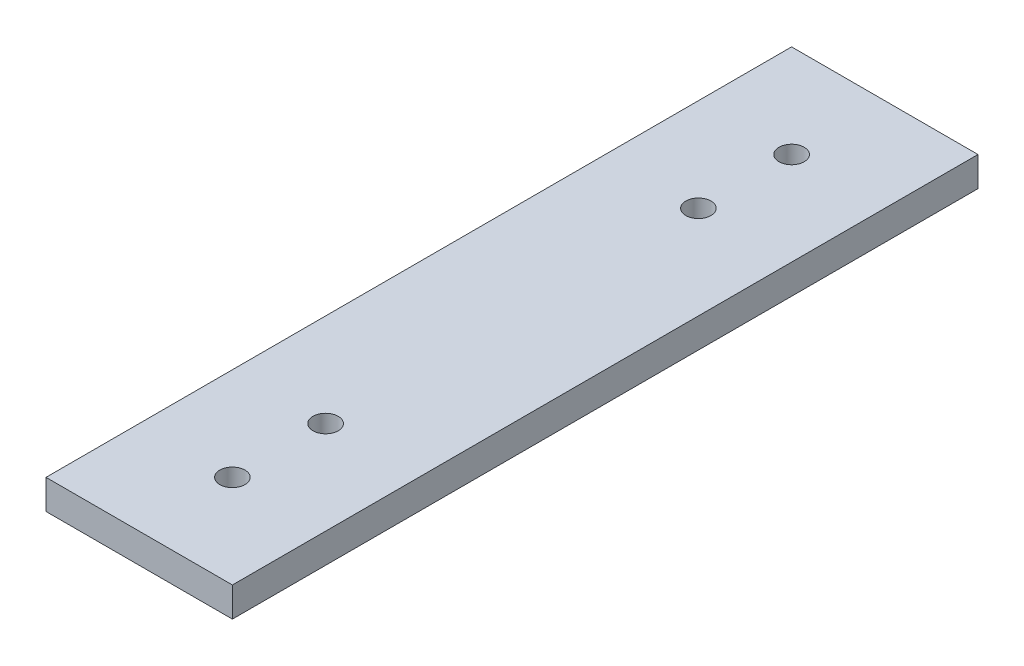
from build123d import *

# Parameters (mm, degrees)
SKETCH1_W                 = 20
SKETCH1_H                 = 80
BOSS_EXTRUDE1_DEPTH       = 3.175
TAP_DRILL_FOR_6_32_TAP1_D = 2.7051


with BuildPart() as part:
    # Sketch1 → Boss-Extrude1 (new body)
    with BuildSketch(Plane(origin=(0, 0, 0), x_dir=(1, 0, 0), z_dir=(0, 1, 0))):
        Rectangle(SKETCH1_W, SKETCH1_H)
    extrude(amount=BOSS_EXTRUDE1_DEPTH)

    # Tap Drill for _6-32 Tap1 (through all)
    with Locations(Plane(origin=(0, 3.175, 0), x_dir=(1, 0, 0), z_dir=(0, 1, 0))):
        with Locations((0, 30), (0, 20)):
            tap_drill_for_6_32_tap1 = Hole(TAP_DRILL_FOR_6_32_TAP1_D / 2)

    # Mirror1: Tap Drill for _6-32 Tap1 across plane
    add(tap_drill_for_6_32_tap1.mirror(Plane.XY), mode=Mode.SUBTRACT)


solid = part.part
